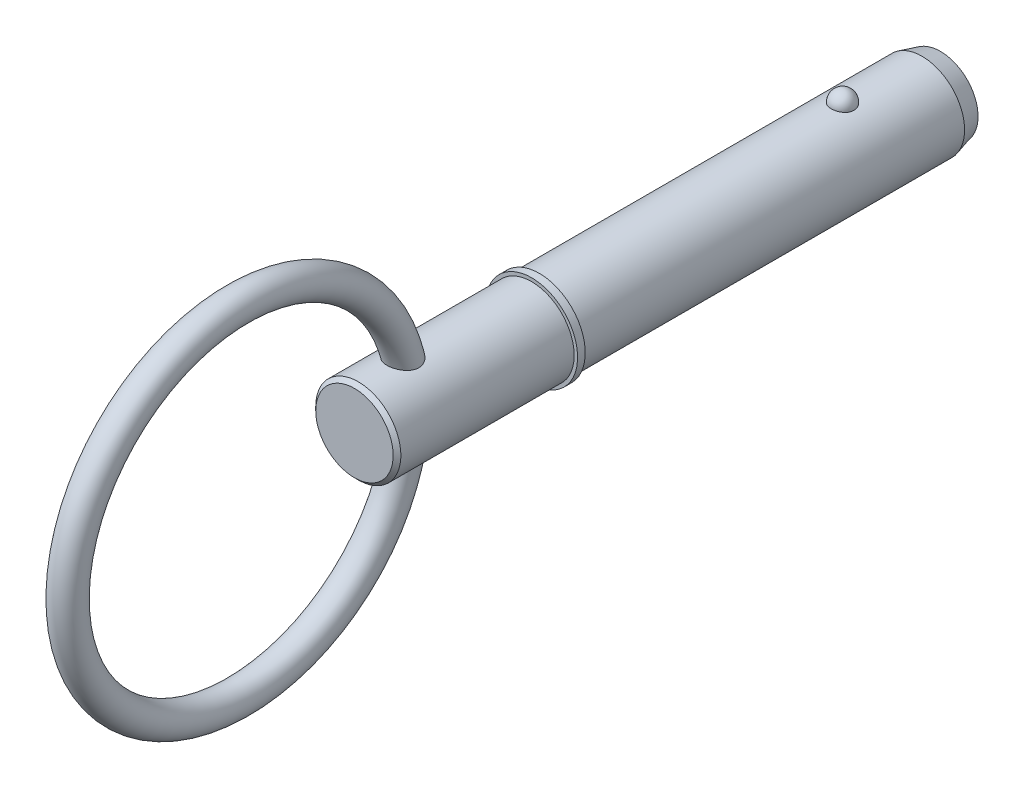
ISO-10303-21;
HEADER;
FILE_DESCRIPTION(('STEP AP214'),'2;1');
FILE_NAME('part.step','',(''),(''),'','','');
FILE_SCHEMA(('AUTOMOTIVE_DESIGN { 1 0 10303 214 1 1 1 1 }'));
ENDSEC;
DATA;
#1=APPLICATION_CONTEXT('core data for automotive mechanical design processes');
#2=APPLICATION_PROTOCOL_DEFINITION('international standard','automotive_design',2000,#1);
#3=PRODUCT_CONTEXT('',#1,'mechanical');
#4=PRODUCT('Part','Part','',(#3));
#5=PRODUCT_RELATED_PRODUCT_CATEGORY('part','',(#4));
#6=PRODUCT_DEFINITION_FORMATION('','',#4);
#7=PRODUCT_DEFINITION_CONTEXT('part definition',#1,'design');
#8=PRODUCT_DEFINITION('design','',#6,#7);
#9=PRODUCT_DEFINITION_SHAPE('','',#8);
#10=(LENGTH_UNIT() NAMED_UNIT(*) SI_UNIT(.MILLI.,.METRE.));
#11=(NAMED_UNIT(*) PLANE_ANGLE_UNIT() SI_UNIT($,.RADIAN.));
#12=(NAMED_UNIT(*) SI_UNIT($,.STERADIAN.) SOLID_ANGLE_UNIT());
#13=UNCERTAINTY_MEASURE_WITH_UNIT(LENGTH_MEASURE(1.E-05),#10,'distance_accuracy_value','');
#14=(GEOMETRIC_REPRESENTATION_CONTEXT(3) GLOBAL_UNCERTAINTY_ASSIGNED_CONTEXT((#13)) GLOBAL_UNIT_ASSIGNED_CONTEXT((#10,
#11,#12)) REPRESENTATION_CONTEXT('',''));
#15=CARTESIAN_POINT('',(0.,0.,0.));
#16=DIRECTION('',(0.,0.,1.));
#17=DIRECTION('',(1.,0.,0.));
#18=AXIS2_PLACEMENT_3D('',#15,#16,#17);
#19=CARTESIAN_POINT('',(0.,0.,38.1));
#20=DIRECTION('',(0.,0.,-1.));
#21=DIRECTION('',(-1.,0.,0.));
#22=AXIS2_PLACEMENT_3D('',#19,#20,#21);
#23=CYLINDRICAL_SURFACE('',#22,5.555);
#24=CARTESIAN_POINT('',(1.47653932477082,5.35517101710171,-1.49));
#25=CARTESIAN_POINT('',(1.4765376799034,5.35517235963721,-1.40667872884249));
#26=CARTESIAN_POINT('',(1.4697233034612,5.35706459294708,-1.32333626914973));
#27=CARTESIAN_POINT('',(1.4426291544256,5.36442332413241,-1.15900769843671));
#28=CARTESIAN_POINT('',(1.42234344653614,5.36989139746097,-1.07802264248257));
#29=CARTESIAN_POINT('',(1.36882802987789,5.38378061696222,-0.920757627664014));
#30=CARTESIAN_POINT('',(1.33560404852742,5.39220045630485,-0.844475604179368));
#31=CARTESIAN_POINT('',(1.25704906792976,5.41105136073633,-0.69870312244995));
#32=CARTESIAN_POINT('',(1.21171855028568,5.42148234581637,-0.62921239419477));
#33=CARTESIAN_POINT('',(1.10986325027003,5.44324765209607,-0.498626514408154));
#34=CARTESIAN_POINT('',(1.05328868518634,5.45458585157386,-0.43757082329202));
#35=CARTESIAN_POINT('',(0.930545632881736,5.4768596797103,-0.325918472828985));
#36=CARTESIAN_POINT('',(0.864377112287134,5.48779530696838,-0.275321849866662));
#37=CARTESIAN_POINT('',(0.724412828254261,5.50801510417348,-0.186125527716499));
#38=CARTESIAN_POINT('',(0.650637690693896,5.51730356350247,-0.147494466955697));
#39=CARTESIAN_POINT('',(0.497383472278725,5.53322345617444,-0.0831582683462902));
#40=CARTESIAN_POINT('',(0.417904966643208,5.53985515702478,-0.0574518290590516));
#41=CARTESIAN_POINT('',(0.256903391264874,5.54963245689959,-0.0200294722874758));
#42=CARTESIAN_POINT('',(0.17543580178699,5.55283384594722,-0.00808940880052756));
#43=CARTESIAN_POINT('',(0.011588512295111,5.55559187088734,0.0022143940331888));
#44=CARTESIAN_POINT('',(-0.0707911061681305,5.55514883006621,0.000579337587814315));
#45=CARTESIAN_POINT('',(-0.232980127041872,5.55069756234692,-0.0161051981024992));
#46=CARTESIAN_POINT('',(-0.312809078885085,5.54673626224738,-0.0309781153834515));
#47=CARTESIAN_POINT('',(-0.468771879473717,5.5357377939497,-0.0734743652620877));
#48=CARTESIAN_POINT('',(-0.544905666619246,5.52870057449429,-0.101097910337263));
#49=CARTESIAN_POINT('',(-0.691800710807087,5.51225307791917,-0.168516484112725));
#50=CARTESIAN_POINT('',(-0.762530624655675,5.50283015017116,-0.208376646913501));
#51=CARTESIAN_POINT('',(-0.896294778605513,5.48263289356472,-0.299136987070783));
#52=CARTESIAN_POINT('',(-0.959328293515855,5.47185843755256,-0.350038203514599));
#53=CARTESIAN_POINT('',(-1.0771278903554,5.44990641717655,-0.462517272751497));
#54=CARTESIAN_POINT('',(-1.13172901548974,5.43872509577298,-0.524267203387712));
#55=CARTESIAN_POINT('',(-1.2299173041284,5.41736658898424,-0.656133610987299));
#56=CARTESIAN_POINT('',(-1.2735037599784,5.40718946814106,-0.726250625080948));
#57=CARTESIAN_POINT('',(-1.34896420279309,5.38886361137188,-0.873713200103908));
#58=CARTESIAN_POINT('',(-1.38071142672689,5.38073711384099,-0.951126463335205));
#59=CARTESIAN_POINT('',(-1.4310375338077,5.36757288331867,-1.11037033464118));
#60=CARTESIAN_POINT('',(-1.44961676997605,5.3625350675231,-1.19220082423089));
#61=CARTESIAN_POINT('',(-1.47308754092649,5.35613553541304,-1.35761209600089));
#62=CARTESIAN_POINT('',(-1.47803294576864,5.35475935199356,-1.44118467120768));
#63=CARTESIAN_POINT('',(-1.47426441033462,5.35579807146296,-1.6079958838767));
#64=CARTESIAN_POINT('',(-1.46555080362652,5.35821288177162,-1.69123452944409));
#65=CARTESIAN_POINT('',(-1.43475662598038,5.36653964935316,-1.8546288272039));
#66=CARTESIAN_POINT('',(-1.41273621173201,5.37243586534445,-1.93479663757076));
#67=CARTESIAN_POINT('',(-1.35593151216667,5.38705199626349,-2.0902011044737));
#68=CARTESIAN_POINT('',(-1.32114675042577,5.39577201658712,-2.16543757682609));
#69=CARTESIAN_POINT('',(-1.23947506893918,5.41511674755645,-2.30926926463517));
#70=CARTESIAN_POINT('',(-1.1925277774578,5.42575087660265,-2.37782893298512));
#71=CARTESIAN_POINT('',(-1.08780725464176,5.44771095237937,-2.50598876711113));
#72=CARTESIAN_POINT('',(-1.03003365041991,5.45903692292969,-2.56558862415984));
#73=CARTESIAN_POINT('',(-0.904953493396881,5.48116073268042,-2.67436535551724));
#74=CARTESIAN_POINT('',(-0.837616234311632,5.49195671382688,-2.7235073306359));
#75=CARTESIAN_POINT('',(-0.695379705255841,5.51177099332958,-2.8097317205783));
#76=CARTESIAN_POINT('',(-0.620480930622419,5.52078940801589,-2.84681492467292));
#77=CARTESIAN_POINT('',(-0.466144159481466,5.53594369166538,-2.90749751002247));
#78=CARTESIAN_POINT('',(-0.386768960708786,5.54211181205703,-2.93124844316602));
#79=CARTESIAN_POINT('',(-0.224991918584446,5.5510324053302,-2.96523308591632));
#80=CARTESIAN_POINT('',(-0.142590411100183,5.55378525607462,-2.97546829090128));
#81=CARTESIAN_POINT('',(0.0213711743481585,5.55555351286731,-2.98206550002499));
#82=CARTESIAN_POINT('',(0.102921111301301,5.55463281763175,-2.97866468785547));
#83=CARTESIAN_POINT('',(0.264256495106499,5.54929804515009,-2.95862186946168));
#84=CARTESIAN_POINT('',(0.344041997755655,5.54488407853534,-2.94198028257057));
#85=CARTESIAN_POINT('',(0.499344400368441,5.53305794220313,-2.89600357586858));
#86=CARTESIAN_POINT('',(0.57487425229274,5.52565550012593,-2.86670961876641));
#87=CARTESIAN_POINT('',(0.719898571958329,5.50863937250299,-2.79624249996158));
#88=CARTESIAN_POINT('',(0.78939269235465,5.49902555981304,-2.75506865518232));
#89=CARTESIAN_POINT('',(0.921480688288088,5.47845199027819,-2.66127110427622));
#90=CARTESIAN_POINT('',(0.983960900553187,5.46747485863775,-2.60849118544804));
#91=CARTESIAN_POINT('',(1.09925057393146,5.44546837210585,-2.49325304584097));
#92=CARTESIAN_POINT('',(1.15205830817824,5.43443900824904,-2.43079310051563));
#93=CARTESIAN_POINT('',(1.24742943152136,5.41335152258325,-2.29680711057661));
#94=CARTESIAN_POINT('',(1.28981661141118,5.40331162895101,-2.22515272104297));
#95=CARTESIAN_POINT('',(1.36214937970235,5.38553336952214,-2.07558035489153));
#96=CARTESIAN_POINT('',(1.39210034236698,5.37779400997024,-1.99766510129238));
#97=CARTESIAN_POINT('',(1.43569518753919,5.36630594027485,-1.84848338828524));
#98=CARTESIAN_POINT('',(1.45098536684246,5.36216169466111,-1.77772322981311));
#99=CARTESIAN_POINT('',(1.47140805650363,5.35659367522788,-1.63464735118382));
#100=CARTESIAN_POINT('',(1.47654075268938,5.35516985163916,-1.56233165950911));
#101=CARTESIAN_POINT('',(1.47653932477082,5.35517101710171,-1.49));
#102=B_SPLINE_CURVE_WITH_KNOTS('',3,(#24,#25,#26,#27,#28,#29,#30,#31,#32,#33,#34,#35,#36,#37,
#38,#39,#40,#41,#42,#43,#44,#45,#46,#47,#48,#49,#50,#51,#52,#53,#54,#55,#56,#57,#58,#59,#60,#61,
#62,#63,#64,#65,#66,#67,#68,#69,#70,#71,#72,#73,#74,#75,#76,#77,#78,#79,#80,#81,#82,#83,#84,#85,
#86,#87,#88,#89,#90,#91,#92,#93,#94,#95,#96,#97,#98,#99,#100,#101),.UNSPECIFIED.,.T.,.F.,(4,2,2,
2,2,2,2,2,2,2,2,2,2,2,2,2,2,2,2,2,2,2,2,2,2,2,2,2,2,2,2,2,2,2,2,2,2,2,4),(0.,0.249703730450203,
0.4995175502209,0.749220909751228,0.998914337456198,1.24973894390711,1.50056442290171,
1.75072681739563,2.00086401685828,2.24686822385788,2.49285060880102,2.73560052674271,
2.97835449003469,3.22242369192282,3.46651587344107,3.71490232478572,3.96330473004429,
4.21429522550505,4.46527899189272,4.71526963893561,4.96525418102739,5.21411697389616,
5.46298905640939,5.71312097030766,5.96326150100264,6.21422412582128,6.46517032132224,
6.71320296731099,6.96120816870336,7.20491846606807,7.44862104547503,7.69153667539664,
7.93446627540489,8.18089104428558,8.42735976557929,8.67774679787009,8.92802551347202,
9.14479867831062,9.36156787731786),.UNSPECIFIED.);
#103=CARTESIAN_POINT('',(1.47653932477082,5.35517101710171,-1.49));
#104=VERTEX_POINT('',#103);
#105=EDGE_CURVE('E102',#104,#104,#102,.T.);
#106=ORIENTED_EDGE('',*,*,#105,.T.);
#107=EDGE_LOOP('',(#106));
#108=FACE_BOUND('',#107,.T.);
#109=CARTESIAN_POINT('',(0.,0.,-11.87));
#110=DIRECTION('',(0.,0.,-1.));
#111=DIRECTION('',(-1.,0.,0.));
#112=AXIS2_PLACEMENT_3D('',#109,#110,#111);
#113=CIRCLE('',#112,5.555);
#114=CARTESIAN_POINT('',(-5.555,0.,-11.87));
#115=VERTEX_POINT('',#114);
#116=EDGE_CURVE('E110',#115,#115,#113,.F.);
#117=ORIENTED_EDGE('',*,*,#116,.T.);
#118=EDGE_LOOP('',(#117));
#119=FACE_BOUND('',#118,.T.);
#120=CARTESIAN_POINT('',(0.,0.,38.1));
#121=DIRECTION('',(0.,0.,1.));
#122=DIRECTION('',(1.,0.,0.));
#123=AXIS2_PLACEMENT_3D('',#120,#121,#122);
#124=CIRCLE('',#123,5.555);
#125=CARTESIAN_POINT('',(5.555,0.,38.1));
#126=VERTEX_POINT('',#125);
#127=EDGE_CURVE('E108',#126,#126,#124,.T.);
#128=ORIENTED_EDGE('',*,*,#127,.F.);
#129=EDGE_LOOP('',(#128));
#130=FACE_BOUND('',#129,.T.);
#131=ADVANCED_FACE('F39',(#108,#119,#130),#23,.T.);
#132=CARTESIAN_POINT('',(0.,0.,-14.27));
#133=DIRECTION('',(0.,0.,-1.));
#134=DIRECTION('',(-1.,0.,0.));
#135=AXIS2_PLACEMENT_3D('',#132,#133,#134);
#136=PLANE('',#135);
#137=CARTESIAN_POINT('',(0.,0.,-14.27));
#138=DIRECTION('',(0.,0.,-1.));
#139=DIRECTION('',(-1.,0.,0.));
#140=AXIS2_PLACEMENT_3D('',#137,#138,#139);
#141=CIRCLE('',#140,4.91192193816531);
#142=CARTESIAN_POINT('',(-4.91192193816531,0.,-14.27));
#143=VERTEX_POINT('',#142);
#144=EDGE_CURVE('E142',#143,#143,#141,.T.);
#145=ORIENTED_EDGE('',*,*,#144,.T.);
#146=EDGE_LOOP('',(#145));
#147=FACE_BOUND('',#146,.T.);
#148=ADVANCED_FACE('F88',(#147),#136,.T.);
#149=CARTESIAN_POINT('',(0.,0.,-14.27));
#150=DIRECTION('',(0.,0.,1.));
#151=DIRECTION('',(1.,0.,0.));
#152=AXIS2_PLACEMENT_3D('',#149,#150,#151);
#153=CONICAL_SURFACE('',#152,4.91192193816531,0.261799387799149);
#154=ORIENTED_EDGE('',*,*,#116,.F.);
#155=EDGE_LOOP('',(#154));
#156=FACE_BOUND('',#155,.T.);
#157=ORIENTED_EDGE('',*,*,#144,.F.);
#158=EDGE_LOOP('',(#157));
#159=FACE_BOUND('',#158,.T.);
#160=ADVANCED_FACE('F94',(#156,#159),#153,.T.);
#161=CARTESIAN_POINT('',(0.,5.555,-1.49));
#162=DIRECTION('',(0.,1.,0.));
#163=DIRECTION('',(0.,0.,1.));
#164=AXIS2_PLACEMENT_3D('',#161,#162,#163);
#165=SPHERICAL_SURFACE('',#164,1.49);
#166=ORIENTED_EDGE('',*,*,#105,.F.);
#167=EDGE_LOOP('',(#166));
#168=FACE_BOUND('',#167,.T.);
#169=ADVANCED_FACE('F113',(#168),#165,.T.);
#170=CARTESIAN_POINT('',(0.,0.,38.1));
#171=DIRECTION('',(0.,0.,-1.));
#172=DIRECTION('',(-1.,0.,0.));
#173=AXIS2_PLACEMENT_3D('',#170,#171,#172);
#174=PLANE('',#173);
#175=ORIENTED_EDGE('',*,*,#127,.T.);
#176=EDGE_LOOP('',(#175));
#177=FACE_BOUND('',#176,.T.);
#178=CARTESIAN_POINT('',(0.,0.,38.1));
#179=DIRECTION('',(0.,0.,-1.));
#180=DIRECTION('',(-1.,0.,0.));
#181=AXIS2_PLACEMENT_3D('',#178,#179,#180);
#182=CIRCLE('',#181,6.);
#183=CARTESIAN_POINT('',(-6.,0.,38.1));
#184=VERTEX_POINT('',#183);
#185=EDGE_CURVE('E109',#184,#184,#182,.T.);
#186=ORIENTED_EDGE('',*,*,#185,.T.);
#187=EDGE_LOOP('',(#186));
#188=FACE_BOUND('',#187,.T.);
#189=ADVANCED_FACE('F117',(#177,#188),#174,.T.);
#190=CARTESIAN_POINT('',(0.,0.,33.7287874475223));
#191=DIRECTION('',(0.,0.,-1.));
#192=DIRECTION('',(-1.,0.,0.));
#193=AXIS2_PLACEMENT_3D('',#190,#191,#192);
#194=CYLINDRICAL_SURFACE('',#193,6.);
#195=CARTESIAN_POINT('',(0.,0.,39.1));
#196=DIRECTION('',(0.,0.,-1.));
#197=DIRECTION('',(-1.,0.,0.));
#198=AXIS2_PLACEMENT_3D('',#195,#196,#197);
#199=CIRCLE('',#198,6.);
#200=CARTESIAN_POINT('',(-6.,0.,39.1));
#201=VERTEX_POINT('',#200);
#202=EDGE_CURVE('E134',#201,#201,#199,.T.);
#203=ORIENTED_EDGE('',*,*,#202,.T.);
#204=EDGE_LOOP('',(#203));
#205=FACE_BOUND('',#204,.T.);
#206=ORIENTED_EDGE('',*,*,#185,.F.);
#207=EDGE_LOOP('',(#206));
#208=FACE_BOUND('',#207,.T.);
#209=ADVANCED_FACE('F121',(#205,#208),#194,.T.);
#210=CARTESIAN_POINT('',(0.,6.,39.1));
#211=DIRECTION('',(0.,0.,1.));
#212=DIRECTION('',(1.,0.,0.));
#213=AXIS2_PLACEMENT_3D('',#210,#211,#212);
#214=PLANE('',#213);
#215=CARTESIAN_POINT('',(0.,0.,39.1));
#216=DIRECTION('',(0.,0.,1.));
#217=DIRECTION('',(1.,0.,0.));
#218=AXIS2_PLACEMENT_3D('',#215,#216,#217);
#219=CIRCLE('',#218,5.555);
#220=CARTESIAN_POINT('',(5.555,0.,39.1));
#221=VERTEX_POINT('',#220);
#222=EDGE_CURVE('E112',#221,#221,#219,.T.);
#223=ORIENTED_EDGE('',*,*,#222,.F.);
#224=EDGE_LOOP('',(#223));
#225=FACE_BOUND('',#224,.T.);
#226=ORIENTED_EDGE('',*,*,#202,.F.);
#227=EDGE_LOOP('',(#226));
#228=FACE_BOUND('',#227,.T.);
#229=ADVANCED_FACE('F85',(#225,#228),#214,.T.);
#230=CARTESIAN_POINT('',(0.,0.,62.23));
#231=DIRECTION('',(0.,0.,-1.));
#232=DIRECTION('',(-1.,0.,0.));
#233=AXIS2_PLACEMENT_3D('',#230,#231,#232);
#234=CYLINDRICAL_SURFACE('',#233,5.555);
#235=CARTESIAN_POINT('',(-0.961380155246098,-5.47117658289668,54.1087332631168));
#236=CARTESIAN_POINT('',(-0.863231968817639,-5.48842171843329,54.0575155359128));
#237=CARTESIAN_POINT('',(-0.760548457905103,-5.50372118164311,54.0143181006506));
#238=CARTESIAN_POINT('',(-0.548956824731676,-5.52883500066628,53.9449127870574));
#239=CARTESIAN_POINT('',(-0.44004880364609,-5.53864944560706,53.9187046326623));
#240=CARTESIAN_POINT('',(-0.219033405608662,-5.55178384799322,53.8838646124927));
#241=CARTESIAN_POINT('',(-0.10692500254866,-5.55510169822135,53.8752384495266));
#242=CARTESIAN_POINT('',(0.11723899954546,-5.55489351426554,53.8757834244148));
#243=CARTESIAN_POINT('',(0.229294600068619,-5.55136768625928,53.8849540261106));
#244=CARTESIAN_POINT('',(0.449588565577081,-5.5378711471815,53.9207847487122));
#245=CARTESIAN_POINT('',(0.557843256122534,-5.52793284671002,53.9473569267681));
#246=CARTESIAN_POINT('',(0.76811634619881,-5.50265785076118,54.0173095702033));
#247=CARTESIAN_POINT('',(0.870134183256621,-5.48732066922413,54.0606915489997));
#248=CARTESIAN_POINT('',(1.0658088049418,-5.4527079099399,54.1636854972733));
#249=CARTESIAN_POINT('',(1.15940337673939,-5.43340601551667,54.2234068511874));
#250=CARTESIAN_POINT('',(1.33484934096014,-5.39298781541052,54.3576727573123));
#251=CARTESIAN_POINT('',(1.41670019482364,-5.37187142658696,54.4322179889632));
#252=CARTESIAN_POINT('',(1.56628651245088,-5.33017932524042,54.5944337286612));
#253=CARTESIAN_POINT('',(1.63402728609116,-5.30960341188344,54.6820992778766));
#254=CARTESIAN_POINT('',(1.75338323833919,-5.27139606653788,54.86835593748));
#255=CARTESIAN_POINT('',(1.80500413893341,-5.25376359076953,54.9669431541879));
#256=CARTESIAN_POINT('',(1.88923054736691,-5.22405733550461,55.1688661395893));
#257=CARTESIAN_POINT('',(1.92240068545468,-5.21182119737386,55.2719426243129));
#258=CARTESIAN_POINT('',(1.97156802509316,-5.19342304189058,55.4826121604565));
#259=CARTESIAN_POINT('',(1.98756752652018,-5.18726021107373,55.5902046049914));
#260=CARTESIAN_POINT('',(2.00238957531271,-5.1815556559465,55.8048133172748));
#261=CARTESIAN_POINT('',(2.0015062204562,-5.18190056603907,55.9118070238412));
#262=CARTESIAN_POINT('',(1.98404322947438,-5.18861029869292,56.1242949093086));
#263=CARTESIAN_POINT('',(1.96745884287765,-5.19497694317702,56.22978862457));
#264=CARTESIAN_POINT('',(1.91810947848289,-5.21340722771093,56.4437346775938));
#265=CARTESIAN_POINT('',(1.88435438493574,-5.22581720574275,56.5519270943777));
#266=CARTESIAN_POINT('',(1.80161540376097,-5.25491400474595,56.7617187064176));
#267=CARTESIAN_POINT('',(1.75262312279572,-5.27160318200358,56.8633142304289));
#268=CARTESIAN_POINT('',(1.63431251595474,-5.30955034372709,57.0688565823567));
#269=CARTESIAN_POINT('',(1.56333412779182,-5.33111051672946,57.1717964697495));
#270=CARTESIAN_POINT('',(1.40529607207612,-5.37493145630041,57.3644716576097));
#271=CARTESIAN_POINT('',(1.31822569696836,-5.39719268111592,57.4541980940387));
#272=CARTESIAN_POINT('',(1.12728892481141,-5.44031451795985,57.6190042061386));
#273=CARTESIAN_POINT('',(1.0230989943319,-5.46113424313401,57.693723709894));
#274=CARTESIAN_POINT('',(0.801576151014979,-5.49800171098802,57.8218052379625));
#275=CARTESIAN_POINT('',(0.68426467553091,-5.51405708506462,57.875201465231));
#276=CARTESIAN_POINT('',(0.45687763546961,-5.53719478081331,57.950980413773));
#277=CARTESIAN_POINT('',(0.347974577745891,-5.54519800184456,57.9765844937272));
#278=CARTESIAN_POINT('',(0.127042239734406,-5.55464249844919,58.0067313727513));
#279=CARTESIAN_POINT('',(0.0150164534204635,-5.55609083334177,58.011296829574));
#280=CARTESIAN_POINT('',(-0.191993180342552,-5.55250986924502,57.9999113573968));
#281=CARTESIAN_POINT('',(-0.287160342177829,-5.54836194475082,57.9867524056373));
#282=CARTESIAN_POINT('',(-0.473863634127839,-5.53554271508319,57.9454897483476));
#283=CARTESIAN_POINT('',(-0.565399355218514,-5.52687090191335,57.9173843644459));
#284=CARTESIAN_POINT('',(-0.743786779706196,-5.50572322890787,57.847293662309));
#285=CARTESIAN_POINT('',(-0.830566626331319,-5.49320168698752,57.8051411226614));
#286=CARTESIAN_POINT('',(-0.996720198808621,-5.46549909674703,57.708875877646));
#287=CARTESIAN_POINT('',(-1.07609119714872,-5.45031707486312,57.6547587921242));
#288=CARTESIAN_POINT('',(-1.23672272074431,-5.41628785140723,57.5282113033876));
#289=CARTESIAN_POINT('',(-1.31676039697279,-5.39722327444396,57.4542891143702));
#290=CARTESIAN_POINT('',(-1.46504263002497,-5.3588760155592,57.295462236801));
#291=CARTESIAN_POINT('',(-1.53327828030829,-5.33959318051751,57.2105493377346));
#292=CARTESIAN_POINT('',(-1.66602271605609,-5.29979878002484,57.0186972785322));
#293=CARTESIAN_POINT('',(-1.72857256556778,-5.27951148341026,56.9103478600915));
#294=CARTESIAN_POINT('',(-1.83559571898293,-5.24326402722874,56.6843258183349));
#295=CARTESIAN_POINT('',(-1.88006296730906,-5.22730531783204,56.5666500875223));
#296=CARTESIAN_POINT('',(-1.94988009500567,-5.20167534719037,56.3220877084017));
#297=CARTESIAN_POINT('',(-1.97477410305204,-5.19215470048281,56.1950527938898));
#298=CARTESIAN_POINT('',(-2.00168294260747,-5.18184594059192,55.9382494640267));
#299=CARTESIAN_POINT('',(-2.0037221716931,-5.18104851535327,55.8084841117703));
#300=CARTESIAN_POINT('',(-1.98467753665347,-5.18836681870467,55.564652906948));
#301=CARTESIAN_POINT('',(-1.96600067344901,-5.19555485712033,55.4503700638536));
#302=CARTESIAN_POINT('',(-1.9092354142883,-5.21668050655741,55.227389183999));
#303=CARTESIAN_POINT('',(-1.87115335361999,-5.23061591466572,55.1186893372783));
#304=CARTESIAN_POINT('',(-1.78015350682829,-5.26224244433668,54.9183712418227));
#305=CARTESIAN_POINT('',(-1.72857344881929,-5.27957041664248,54.8260829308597));
#306=CARTESIAN_POINT('',(-1.61106729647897,-5.31660340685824,54.6516847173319));
#307=CARTESIAN_POINT('',(-1.5451402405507,-5.33630858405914,54.5695754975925));
#308=CARTESIAN_POINT('',(-1.39929408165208,-5.37641320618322,54.4158871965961));
#309=CARTESIAN_POINT('',(-1.31912544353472,-5.39681868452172,54.3445467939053));
#310=CARTESIAN_POINT('',(-1.14786008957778,-5.43582099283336,54.2158557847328));
#311=CARTESIAN_POINT('',(-1.05676174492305,-5.4544175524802,54.1585072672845));
#312=CARTESIAN_POINT('',(-0.961380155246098,-5.47117658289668,54.1087332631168));
#313=B_SPLINE_CURVE_WITH_KNOTS('',3,(#235,#236,#237,#238,#239,#240,#241,#242,#243,#244,#245,
#246,#247,#248,#249,#250,#251,#252,#253,#254,#255,#256,#257,#258,#259,#260,#261,#262,#263,#264,
#265,#266,#267,#268,#269,#270,#271,#272,#273,#274,#275,#276,#277,#278,#279,#280,#281,#282,#283,
#284,#285,#286,#287,#288,#289,#290,#291,#292,#293,#294,#295,#296,#297,#298,#299,#300,#301,#302,
#303,#304,#305,#306,#307,#308,#309,#310,#311,#312),.UNSPECIFIED.,.T.,.F.,(4,2,2,2,2,2,2,2,2,2,2,
2,2,2,2,2,2,2,2,2,2,2,2,2,2,2,2,2,2,2,2,2,2,2,2,2,2,2,4),(0.,0.335747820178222,
0.671490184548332,1.00734143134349,1.34318256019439,1.6773394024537,2.01152633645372,
2.34800767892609,2.6845044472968,3.02087435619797,3.3571247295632,3.68242216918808,
4.00767603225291,4.32726924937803,4.6469591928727,4.98762165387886,5.32847210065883,
5.7074287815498,6.0866385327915,6.47407889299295,6.86089527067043,7.19531213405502,
7.52936875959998,7.81649827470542,8.10366003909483,8.39437023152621,8.68518702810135,
9.01572837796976,9.34651809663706,9.72504519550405,10.1036989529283,10.4909301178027,
10.8777478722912,11.2239231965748,11.569985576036,11.8899109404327,12.2098577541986,
12.5360928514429,12.8623766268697),.UNSPECIFIED.);
#314=CARTESIAN_POINT('',(-0.961380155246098,-5.47117658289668,54.1087332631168));
#315=VERTEX_POINT('',#314);
#316=EDGE_CURVE('E10',#315,#315,#313,.T.);
#317=ORIENTED_EDGE('',*,*,#316,.F.);
#318=EDGE_LOOP('',(#317));
#319=FACE_BOUND('',#318,.T.);
#320=CARTESIAN_POINT('',(-0.961380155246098,5.47117658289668,54.1087332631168));
#321=CARTESIAN_POINT('',(-1.05891474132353,5.45403910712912,54.1596311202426));
#322=CARTESIAN_POINT('',(-1.15197270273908,5.43497920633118,54.2184510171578));
#323=CARTESIAN_POINT('',(-1.32661268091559,5.39501222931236,54.3507016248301));
#324=CARTESIAN_POINT('',(-1.40819495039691,5.37410519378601,54.4241320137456));
#325=CARTESIAN_POINT('',(-1.55769110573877,5.33269731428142,54.584098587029));
#326=CARTESIAN_POINT('',(-1.62558729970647,5.31219702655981,54.6706514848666));
#327=CARTESIAN_POINT('',(-1.74556031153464,5.2739951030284,54.8546466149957));
#328=CARTESIAN_POINT('',(-1.7976419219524,5.25629262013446,54.9520855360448));
#329=CARTESIAN_POINT('',(-1.88339939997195,5.22617061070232,55.1525656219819));
#330=CARTESIAN_POINT('',(-1.91750373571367,5.21362983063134,55.2554052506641));
#331=CARTESIAN_POINT('',(-1.96852412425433,5.194582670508,55.4657781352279));
#332=CARTESIAN_POINT('',(-1.98544249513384,5.18807547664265,55.5733107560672));
#333=CARTESIAN_POINT('',(-2.00201964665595,5.18170011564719,55.7878197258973));
#334=CARTESIAN_POINT('',(-2.00199605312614,5.18170977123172,55.894768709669));
#335=CARTESIAN_POINT('',(-1.98621575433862,5.18777751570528,56.1073062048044));
#336=CARTESIAN_POINT('',(-1.97045441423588,5.19383738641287,56.2128943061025));
#337=CARTESIAN_POINT('',(-1.92280904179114,5.21167084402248,56.4269141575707));
#338=CARTESIAN_POINT('',(-1.88996782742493,5.22378174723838,56.5351030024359));
#339=CARTESIAN_POINT('',(-1.8090690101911,5.252344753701,56.7450298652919));
#340=CARTESIAN_POINT('',(-1.76100319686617,5.26879919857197,56.846764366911));
#341=CARTESIAN_POINT('',(-1.64464870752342,5.30634509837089,57.0527880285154));
#342=CARTESIAN_POINT('',(-1.57469702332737,5.32774959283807,57.1560850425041));
#343=CARTESIAN_POINT('',(-1.41872356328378,5.37138743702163,57.3496881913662));
#344=CARTESIAN_POINT('',(-1.33269066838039,5.39362135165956,57.4399852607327));
#345=CARTESIAN_POINT('',(-1.14345202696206,5.43692909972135,57.6065572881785));
#346=CARTESIAN_POINT('',(-1.03986000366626,5.45795811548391,57.6824096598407));
#347=CARTESIAN_POINT('',(-0.81933821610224,5.49537389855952,57.8129167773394));
#348=CARTESIAN_POINT('',(-0.702429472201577,5.51176784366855,57.8676043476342));
#349=CARTESIAN_POINT('',(-0.475167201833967,5.53565843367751,57.9460220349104));
#350=CARTESIAN_POINT('',(-0.365997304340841,5.54404610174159,57.9728937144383));
#351=CARTESIAN_POINT('',(-0.144272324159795,5.55422966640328,58.0054265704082));
#352=CARTESIAN_POINT('',(-0.0317212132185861,5.55603301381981,58.0111117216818));
#353=CARTESIAN_POINT('',(0.176166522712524,5.55303883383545,58.0015929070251));
#354=CARTESIAN_POINT('',(0.271662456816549,5.54914868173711,57.9892608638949));
#355=CARTESIAN_POINT('',(0.459140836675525,5.53678955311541,57.9495233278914));
#356=CARTESIAN_POINT('',(0.551122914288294,5.52832009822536,57.922116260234));
#357=CARTESIAN_POINT('',(0.730082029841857,5.50755841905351,57.8534371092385));
#358=CARTESIAN_POINT('',(0.817013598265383,5.49523641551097,57.8120568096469));
#359=CARTESIAN_POINT('',(0.983569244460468,5.46788364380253,57.7172936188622));
#360=CARTESIAN_POINT('',(1.06319070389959,5.45285191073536,57.6639064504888));
#361=CARTESIAN_POINT('',(1.22430017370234,5.4191117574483,57.5389828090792));
#362=CARTESIAN_POINT('',(1.30459540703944,5.40018081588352,57.4659703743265));
#363=CARTESIAN_POINT('',(1.45353150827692,5.3620139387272,57.3089433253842));
#364=CARTESIAN_POINT('',(1.52216366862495,5.3427777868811,57.2249205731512));
#365=CARTESIAN_POINT('',(1.65601602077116,5.30294271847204,57.0348114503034));
#366=CARTESIAN_POINT('',(1.71927851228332,5.28255425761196,56.9272944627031));
#367=CARTESIAN_POINT('',(1.82790996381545,5.24595721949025,56.7028474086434));
#368=CARTESIAN_POINT('',(1.8732722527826,5.22975020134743,56.5859138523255));
#369=CARTESIAN_POINT('',(1.94526503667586,5.20341207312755,56.3421941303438));
#370=CARTESIAN_POINT('',(1.97135787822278,5.1934564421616,56.2152273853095));
#371=CARTESIAN_POINT('',(2.00068973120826,5.18223330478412,55.958318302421));
#372=CARTESIAN_POINT('',(2.00395290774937,5.18095661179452,55.8283792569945));
#373=CARTESIAN_POINT('',(1.98717985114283,5.1874070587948,55.583763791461));
#374=CARTESIAN_POINT('',(1.96951989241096,5.19421607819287,55.4688994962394));
#375=CARTESIAN_POINT('',(1.91463360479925,5.2146960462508,55.2445890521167));
#376=CARTESIAN_POINT('',(1.87741409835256,5.22836460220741,55.1351410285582));
#377=CARTESIAN_POINT('',(1.78800305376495,5.25957304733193,54.9335428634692));
#378=CARTESIAN_POINT('',(1.73720600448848,5.27672774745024,54.8407093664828));
#379=CARTESIAN_POINT('',(1.62116201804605,5.3135255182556,54.6651218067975));
#380=CARTESIAN_POINT('',(1.55591428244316,5.33316872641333,54.5823683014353));
#381=CARTESIAN_POINT('',(1.41164041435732,5.37317145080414,54.4276485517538));
#382=CARTESIAN_POINT('',(1.33241957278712,5.39353732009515,54.3558657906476));
#383=CARTESIAN_POINT('',(1.16300716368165,5.43258596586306,54.2261126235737));
#384=CARTESIAN_POINT('',(1.07281393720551,5.45126848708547,54.1681443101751));
#385=CARTESIAN_POINT('',(0.880638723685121,5.48564753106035,54.0655070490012));
#386=CARTESIAN_POINT('',(0.778364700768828,5.50122427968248,54.0213437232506));
#387=CARTESIAN_POINT('',(0.567418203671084,5.52696543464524,53.9499735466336));
#388=CARTESIAN_POINT('',(0.458745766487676,5.53712987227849,53.9227665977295));
#389=CARTESIAN_POINT('',(0.237791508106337,5.55101406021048,53.8858797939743));
#390=CARTESIAN_POINT('',(0.125501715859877,5.55471842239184,53.8762417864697));
#391=CARTESIAN_POINT('',(-0.0992056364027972,5.55525045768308,53.8748490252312));
#392=CARTESIAN_POINT('',(-0.21162319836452,5.55207802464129,53.8830945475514));
#393=CARTESIAN_POINT('',(-0.434217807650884,5.53913427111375,53.917408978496));
#394=CARTESIAN_POINT('',(-0.54437038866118,5.52931142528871,53.9436170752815));
#395=CARTESIAN_POINT('',(-0.758352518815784,5.50404767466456,54.0133955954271));
#396=CARTESIAN_POINT('',(-0.862181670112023,5.48860641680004,54.0569671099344));
#397=CARTESIAN_POINT('',(-0.961380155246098,5.47117658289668,54.1087332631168));
#398=B_SPLINE_CURVE_WITH_KNOTS('',3,(#320,#321,#322,#323,#324,#325,#326,#327,#328,#329,#330,
#331,#332,#333,#334,#335,#336,#337,#338,#339,#340,#341,#342,#343,#344,#345,#346,#347,#348,#349,
#350,#351,#352,#353,#354,#355,#356,#357,#358,#359,#360,#361,#362,#363,#364,#365,#366,#367,#368,
#369,#370,#371,#372,#373,#374,#375,#376,#377,#378,#379,#380,#381,#382,#383,#384,#385,#386,#387,
#388,#389,#390,#391,#392,#393,#394,#395,#396,#397),.UNSPECIFIED.,.T.,.F.,(4,2,2,2,2,2,2,2,2,2,2,
2,2,2,2,2,2,2,2,2,2,2,2,2,2,2,2,2,2,2,2,2,2,2,2,2,2,2,4),(0.,0.33363642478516,0.66726550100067,
1.00132312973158,1.33527942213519,1.66086829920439,1.98641325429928,2.3058550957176,
2.62539104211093,2.96514840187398,3.30508930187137,3.68313901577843,4.06145109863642,
4.4495380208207,4.83702062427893,5.17316628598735,5.508931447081,5.79666415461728,
6.08442692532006,6.37447144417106,6.66461944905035,6.99384361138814,7.32331250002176,
7.70083591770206,8.0784998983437,8.46633986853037,8.85376924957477,9.20110411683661,
9.54831791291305,9.86844524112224,10.1885902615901,10.513611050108,10.8386810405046,
11.1745469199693,11.5104108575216,11.8470737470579,12.183741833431,12.5230486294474,
12.8623767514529),.UNSPECIFIED.);
#399=CARTESIAN_POINT('',(-0.961380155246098,5.47117658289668,54.1087332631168));
#400=VERTEX_POINT('',#399);
#401=EDGE_CURVE('E51',#400,#400,#398,.T.);
#402=ORIENTED_EDGE('',*,*,#401,.F.);
#403=EDGE_LOOP('',(#402));
#404=FACE_BOUND('',#403,.T.);
#405=CARTESIAN_POINT('',(0.,0.,61.73));
#406=DIRECTION('',(0.,0.,-1.));
#407=DIRECTION('',(-1.,0.,0.));
#408=AXIS2_PLACEMENT_3D('',#405,#406,#407);
#409=CIRCLE('',#408,5.555);
#410=CARTESIAN_POINT('',(-5.555,0.,61.73));
#411=VERTEX_POINT('',#410);
#412=EDGE_CURVE('E64',#411,#411,#409,.T.);
#413=ORIENTED_EDGE('',*,*,#412,.T.);
#414=EDGE_LOOP('',(#413));
#415=FACE_BOUND('',#414,.T.);
#416=ORIENTED_EDGE('',*,*,#222,.T.);
#417=EDGE_LOOP('',(#416));
#418=FACE_BOUND('',#417,.T.);
#419=ADVANCED_FACE('F69',(#319,#404,#415,#418),#234,.T.);
#420=CARTESIAN_POINT('',(0.,0.,62.23));
#421=DIRECTION('',(0.,0.,-1.));
#422=DIRECTION('',(-1.,0.,0.));
#423=AXIS2_PLACEMENT_3D('',#420,#421,#422);
#424=PLANE('',#423);
#425=CARTESIAN_POINT('',(0.,0.,62.23));
#426=DIRECTION('',(0.,0.,-1.));
#427=DIRECTION('',(-1.,0.,0.));
#428=AXIS2_PLACEMENT_3D('',#425,#426,#427);
#429=CIRCLE('',#428,5.05499999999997);
#430=CARTESIAN_POINT('',(-5.05499999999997,0.,62.23));
#431=VERTEX_POINT('',#430);
#432=EDGE_CURVE('E57',#431,#431,#429,.F.);
#433=ORIENTED_EDGE('',*,*,#432,.T.);
#434=EDGE_LOOP('',(#433));
#435=FACE_BOUND('',#434,.T.);
#436=ADVANCED_FACE('F76',(#435),#424,.F.);
#437=CARTESIAN_POINT('',(0.,0.,61.73));
#438=DIRECTION('',(0.,0.,-1.));
#439=DIRECTION('',(-1.,0.,0.));
#440=AXIS2_PLACEMENT_3D('',#437,#438,#439);
#441=CONICAL_SURFACE('',#440,5.555,0.785398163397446);
#442=ORIENTED_EDGE('',*,*,#432,.F.);
#443=EDGE_LOOP('',(#442));
#444=FACE_BOUND('',#443,.T.);
#445=ORIENTED_EDGE('',*,*,#412,.F.);
#446=EDGE_LOOP('',(#445));
#447=FACE_BOUND('',#446,.T.);
#448=ADVANCED_FACE('F41',(#444,#447),#441,.T.);
#449=CARTESIAN_POINT('',(0.,0.,77.455));
#450=DIRECTION('',(1.,0.,0.));
#451=DIRECTION('',(0.,0.,-1.));
#452=AXIS2_PLACEMENT_3D('',#449,#450,#451);
#453=TOROIDAL_SURFACE('',#452,22.225,2.);
#454=ORIENTED_EDGE('',*,*,#316,.T.);
#455=EDGE_LOOP('',(#454));
#456=FACE_BOUND('',#455,.T.);
#457=ORIENTED_EDGE('',*,*,#401,.T.);
#458=EDGE_LOOP('',(#457));
#459=FACE_BOUND('',#458,.T.);
#460=ADVANCED_FACE('F73',(#456,#459),#453,.T.);
#461=CLOSED_SHELL('',(#131,#148,#160,#169,#189,#209,#229,#419,#436,#448,#460));
#462=MANIFOLD_SOLID_BREP('B2',#461);
#463=ADVANCED_BREP_SHAPE_REPRESENTATION('',(#18,#462),#14);
#464=SHAPE_DEFINITION_REPRESENTATION(#9,#463);
ENDSEC;
END-ISO-10303-21;
